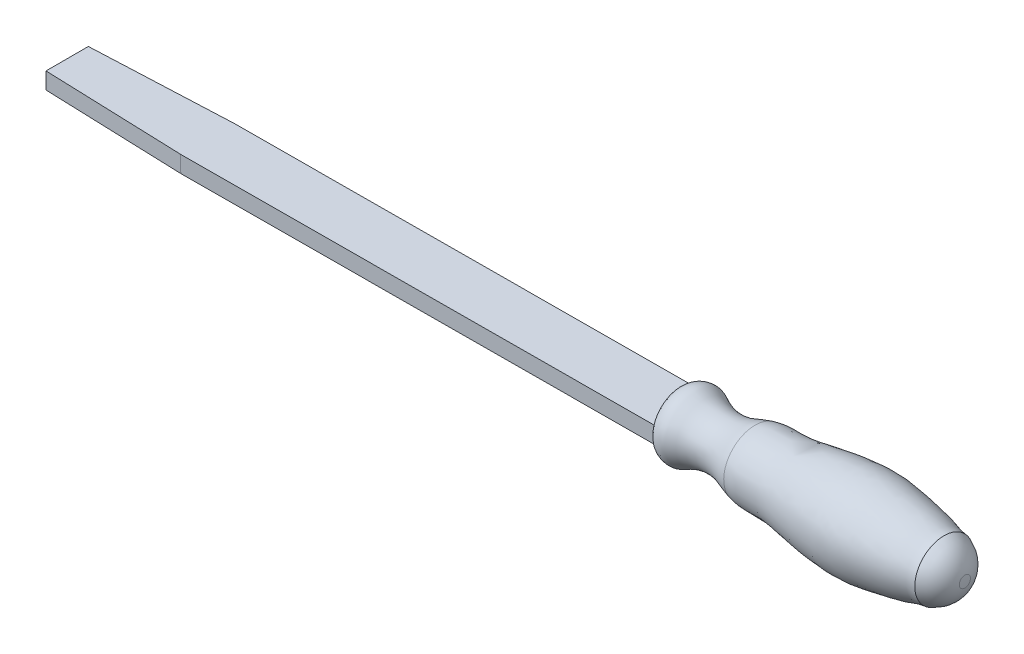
ISO-10303-21;
HEADER;
FILE_DESCRIPTION(('STEP AP214'),'2;1');
FILE_NAME('part.step','',(''),(''),'','','');
FILE_SCHEMA(('AUTOMOTIVE_DESIGN { 1 0 10303 214 1 1 1 1 }'));
ENDSEC;
DATA;
#1=APPLICATION_CONTEXT('core data for automotive mechanical design processes');
#2=APPLICATION_PROTOCOL_DEFINITION('international standard','automotive_design',2000,#1);
#3=PRODUCT_CONTEXT('',#1,'mechanical');
#4=PRODUCT('Part','Part','',(#3));
#5=PRODUCT_RELATED_PRODUCT_CATEGORY('part','',(#4));
#6=PRODUCT_DEFINITION_FORMATION('','',#4);
#7=PRODUCT_DEFINITION_CONTEXT('part definition',#1,'design');
#8=PRODUCT_DEFINITION('design','',#6,#7);
#9=PRODUCT_DEFINITION_SHAPE('','',#8);
#10=(LENGTH_UNIT() NAMED_UNIT(*) SI_UNIT(.MILLI.,.METRE.));
#11=(NAMED_UNIT(*) PLANE_ANGLE_UNIT() SI_UNIT($,.RADIAN.));
#12=(NAMED_UNIT(*) SI_UNIT($,.STERADIAN.) SOLID_ANGLE_UNIT());
#13=UNCERTAINTY_MEASURE_WITH_UNIT(LENGTH_MEASURE(1.E-05),#10,'distance_accuracy_value','');
#14=(GEOMETRIC_REPRESENTATION_CONTEXT(3) GLOBAL_UNCERTAINTY_ASSIGNED_CONTEXT((#13)) GLOBAL_UNIT_ASSIGNED_CONTEXT((#10,
#11,#12)) REPRESENTATION_CONTEXT('',''));
#15=CARTESIAN_POINT('',(0.,0.,0.));
#16=DIRECTION('',(0.,0.,1.));
#17=DIRECTION('',(1.,0.,0.));
#18=AXIS2_PLACEMENT_3D('',#15,#16,#17);
#19=CARTESIAN_POINT('',(-239.997930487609,-4.40953316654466,10.5));
#20=DIRECTION('',(0.00483121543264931,-0.999988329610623,0.));
#21=DIRECTION('',(0.999988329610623,0.00483121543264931,0.));
#22=AXIS2_PLACEMENT_3D('',#19,#20,#21);
#23=PLANE('',#22);
#24=DIRECTION('',(0.999988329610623,0.00483121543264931,0.));
#25=VECTOR('',#24,1.);
#26=CARTESIAN_POINT('',(-239.997930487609,-4.40953316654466,10.5));
#27=LINE('',#26,#25);
#28=CARTESIAN_POINT('',(-184.998572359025,-4.14381631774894,10.5));
#29=VERTEX_POINT('',#28);
#30=CARTESIAN_POINT('',(0.594520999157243,-3.24716563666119,10.5));
#31=VERTEX_POINT('',#30);
#32=EDGE_CURVE('E158',#29,#31,#27,.T.);
#33=ORIENTED_EDGE('',*,*,#32,.F.);
#34=DIRECTION('',(-0.999189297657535,-0.0048273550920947,-0.0399680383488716));
#35=VECTOR('',#34,1.);
#36=CARTESIAN_POINT('',(-239.910072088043,-4.40910869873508,8.30351437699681));
#37=LINE('',#36,#35);
#38=CARTESIAN_POINT('',(-239.997930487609,-4.40953316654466,8.3));
#39=VERTEX_POINT('',#38);
#40=EDGE_CURVE('E136',#29,#39,#37,.T.);
#41=ORIENTED_EDGE('',*,*,#40,.T.);
#42=DIRECTION('',(0.,0.,-1.));
#43=VECTOR('',#42,1.);
#44=CARTESIAN_POINT('',(-239.997930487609,-4.40953316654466,10.5));
#45=LINE('',#44,#43);
#46=CARTESIAN_POINT('',(-239.997930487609,-4.40953316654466,-8.3));
#47=VERTEX_POINT('',#46);
#48=EDGE_CURVE('E62',#39,#47,#45,.T.);
#49=ORIENTED_EDGE('',*,*,#48,.T.);
#50=DIRECTION('',(-0.999189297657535,-0.0048273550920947,0.0399680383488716));
#51=VECTOR('',#50,1.);
#52=CARTESIAN_POINT('',(-240.74872044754,-4.41316043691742,-8.26996805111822));
#53=LINE('',#52,#51);
#54=CARTESIAN_POINT('',(-184.998572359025,-4.14381631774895,-10.5));
#55=VERTEX_POINT('',#54);
#56=EDGE_CURVE('E244',#55,#47,#53,.T.);
#57=ORIENTED_EDGE('',*,*,#56,.F.);
#58=DIRECTION('',(0.999988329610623,0.00483121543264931,0.));
#59=VECTOR('',#58,1.);
#60=CARTESIAN_POINT('',(-239.997930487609,-4.40953316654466,-10.5));
#61=LINE('',#60,#59);
#62=CARTESIAN_POINT('',(0.594520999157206,-3.24716563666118,-10.5));
#63=VERTEX_POINT('',#62);
#64=EDGE_CURVE('E163',#55,#63,#61,.T.);
#65=ORIENTED_EDGE('',*,*,#64,.T.);
#66=CARTESIAN_POINT('',(0.594520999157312,-3.24716563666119,-10.5));
#67=CARTESIAN_POINT('',(0.579849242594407,-3.24723651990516,-10.4807894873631));
#68=CARTESIAN_POINT('',(0.56534511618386,-3.24730659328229,-10.4614554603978));
#69=CARTESIAN_POINT('',(0.536672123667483,-3.2474451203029,-10.4225403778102));
#70=CARTESIAN_POINT('',(0.522503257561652,-3.24751357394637,-10.402959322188));
#71=CARTESIAN_POINT('',(0.50850202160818,-3.24758121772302,-10.3832547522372));
#72=B_SPLINE_CURVE_WITH_KNOTS('',3,(#66,#67,#68,#69,#70,#71),.UNSPECIFIED.,.F.,.F.,(4,2,4),(0.,
0.0725093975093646,0.145018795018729),.UNSPECIFIED.);
#73=CARTESIAN_POINT('',(0.50850202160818,-3.24758121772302,-10.3832547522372));
#74=VERTEX_POINT('',#73);
#75=EDGE_CURVE('E277',#63,#74,#72,.T.);
#76=ORIENTED_EDGE('',*,*,#75,.T.);
#77=CARTESIAN_POINT('',(0.50850202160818,-3.24758121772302,-10.3832547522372));
#78=CARTESIAN_POINT('',(0.472133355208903,-3.24775692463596,-10.1759162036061));
#79=CARTESIAN_POINT('',(0.437648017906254,-3.24792353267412,-9.96824761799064));
#80=CARTESIAN_POINT('',(0.372440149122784,-3.24823856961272,-9.55232557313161));
#81=CARTESIAN_POINT('',(0.34171752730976,-3.24838699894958,-9.34407212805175));
#82=CARTESIAN_POINT('',(0.284029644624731,-3.24866570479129,-8.92704671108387));
#83=CARTESIAN_POINT('',(0.257064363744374,-3.2487959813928,-8.71827474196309));
#84=CARTESIAN_POINT('',(0.20690704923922,-3.24903830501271,-8.30061498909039));
#85=CARTESIAN_POINT('',(0.183709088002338,-3.24915038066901,-8.09172791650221));
#86=CARTESIAN_POINT('',(0.140994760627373,-3.24935674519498,-7.67357744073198));
#87=CARTESIAN_POINT('',(0.121478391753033,-3.24945103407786,-7.46431403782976));
#88=CARTESIAN_POINT('',(0.0860580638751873,-3.24962215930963,-7.04548902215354));
#89=CARTESIAN_POINT('',(0.0701540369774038,-3.24969899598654,-6.83592741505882));
#90=CARTESIAN_POINT('',(0.0245317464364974,-3.24991940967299,-6.15922763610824));
#91=CARTESIAN_POINT('',(0.00181261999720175,-3.25002917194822,-5.69159736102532));
#92=CARTESIAN_POINT('',(-0.0205015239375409,-3.2501369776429,-4.98972472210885));
#93=CARTESIAN_POINT('',(-0.0259787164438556,-3.25016343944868,-4.75564014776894));
#94=CARTESIAN_POINT('',(-0.0334182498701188,-3.25019938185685,-4.28741498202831));
#95=CARTESIAN_POINT('',(-0.0353806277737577,-3.2502088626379,-4.05327439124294));
#96=CARTESIAN_POINT('',(-0.036188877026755,-3.25021276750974,-3.66263496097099));
#97=CARTESIAN_POINT('',(-0.0358524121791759,-3.2502111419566,-3.50613632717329));
#98=CARTESIAN_POINT('',(-0.0340861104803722,-3.25020260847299,-3.19314452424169));
#99=CARTESIAN_POINT('',(-0.0326562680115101,-3.25019570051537,-3.03665135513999));
#100=CARTESIAN_POINT('',(-0.0289792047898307,-3.25017793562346,-2.72367168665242));
#101=CARTESIAN_POINT('',(-0.0267319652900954,-3.2501670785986,-2.56718518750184));
#102=CARTESIAN_POINT('',(-0.021757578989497,-3.25014304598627,-2.25433472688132));
#103=CARTESIAN_POINT('',(-0.0190307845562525,-3.25012987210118,-2.09797075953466));
#104=CARTESIAN_POINT('',(-0.0134857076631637,-3.25010308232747,-1.78524801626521));
#105=CARTESIAN_POINT('',(-0.0106674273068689,-3.25008946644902,-1.6288892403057));
#106=CARTESIAN_POINT('',(-0.00535375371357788,-3.25006379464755,-1.31617544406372));
#107=CARTESIAN_POINT('',(-0.00285834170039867,-3.25005173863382,-1.15982042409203));
#108=CARTESIAN_POINT('',(-0.000731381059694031,-3.25004146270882,-1.00345926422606));
#109=B_SPLINE_CURVE_WITH_KNOTS('',3,(#77,#78,#79,#80,#81,#82,#83,#84,#85,#86,#87,#88,#89,#90,
#91,#92,#93,#94,#95,#96,#97,#98,#99,#100,#101,#102,#103,#104,#105,#106,#107,#108),.UNSPECIFIED.,
.F.,.F.,(4,2,2,2,2,2,2,2,2,2,2,2,2,2,2,4),(0.,0.631503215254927,1.26299126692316,
1.89447595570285,2.52495721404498,3.15543800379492,3.78590694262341,5.19009207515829,
5.89251944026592,6.59493941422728,7.06443286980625,7.53392873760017,8.00343537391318,
8.47259845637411,8.94175075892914,9.41087576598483),.UNSPECIFIED.);
#110=CARTESIAN_POINT('',(-0.000731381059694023,-3.25004146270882,-1.00345926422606));
#111=VERTEX_POINT('',#110);
#112=EDGE_CURVE('E288',#74,#111,#109,.T.);
#113=ORIENTED_EDGE('',*,*,#112,.T.);
#114=DIRECTION('',(0.,0.,-1.));
#115=VECTOR('',#114,1.);
#116=CARTESIAN_POINT('',(-0.000731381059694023,-3.25004146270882,10.5));
#117=LINE('',#116,#115);
#118=CARTESIAN_POINT('',(-0.000731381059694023,-3.25004146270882,1.00345926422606));
#119=VERTEX_POINT('',#118);
#120=EDGE_CURVE('E252',#119,#111,#117,.T.);
#121=ORIENTED_EDGE('',*,*,#120,.F.);
#122=CARTESIAN_POINT('',(-0.000731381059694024,-3.25004146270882,1.00345926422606));
#123=CARTESIAN_POINT('',(-0.00358865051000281,-3.25005526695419,1.21325289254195));
#124=CARTESIAN_POINT('',(-0.00710341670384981,-3.25007224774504,1.42303512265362));
#125=CARTESIAN_POINT('',(-0.0144615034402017,-3.2501077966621,1.84263861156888));
#126=CARTESIAN_POINT('',(-0.0183048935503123,-3.25012636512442,2.05245986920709));
#127=CARTESIAN_POINT('',(-0.0253320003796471,-3.25016031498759,2.47212987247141));
#128=CARTESIAN_POINT('',(-0.0285156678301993,-3.25017569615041,2.68197861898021));
#129=CARTESIAN_POINT('',(-0.0333948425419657,-3.25019926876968,3.10188449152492));
#130=CARTESIAN_POINT('',(-0.0350890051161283,-3.25020745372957,3.31194163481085));
#131=CARTESIAN_POINT('',(-0.036341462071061,-3.25021350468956,3.73204760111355));
#132=CARTESIAN_POINT('',(-0.0358999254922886,-3.25021137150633,3.94209642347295));
#133=CARTESIAN_POINT('',(-0.0324052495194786,-3.2501944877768,4.36216591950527));
#134=CARTESIAN_POINT('',(-0.0293522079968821,-3.25017973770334,4.57218659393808));
#135=CARTESIAN_POINT('',(-0.019767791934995,-3.25013343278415,5.01616384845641));
#136=CARTESIAN_POINT('',(-0.012878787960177,-3.25010015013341,5.25011298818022));
#137=CARTESIAN_POINT('',(0.00491859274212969,-3.25001416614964,5.71786534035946));
#138=CARTESIAN_POINT('',(0.0158270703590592,-3.24996146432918,5.95166854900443));
#139=CARTESIAN_POINT('',(0.0418961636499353,-3.24983551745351,6.41893766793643));
#140=CARTESIAN_POINT('',(0.0570549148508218,-3.24976228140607,6.65240368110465));
#141=CARTESIAN_POINT('',(0.0917875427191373,-3.24959447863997,7.11900103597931));
#142=CARTESIAN_POINT('',(0.111361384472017,-3.24949991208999,7.35213238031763));
#143=CARTESIAN_POINT('',(0.177124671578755,-3.2491821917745,8.05346103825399));
#144=CARTESIAN_POINT('',(0.230216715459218,-3.24892568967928,8.52104089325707));
#145=CARTESIAN_POINT('',(0.323955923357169,-3.24847281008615,9.22068392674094));
#146=CARTESIAN_POINT('',(0.357570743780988,-3.24831040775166,9.45371451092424));
#147=CARTESIAN_POINT('',(0.429505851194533,-3.24796286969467,9.91904972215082));
#148=CARTESIAN_POINT('',(0.467826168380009,-3.24777773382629,10.1513543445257));
#149=CARTESIAN_POINT('',(0.50850202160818,-3.24758121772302,10.3832547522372));
#150=B_SPLINE_CURVE_WITH_KNOTS('',3,(#122,#123,#124,#125,#126,#127,#128,#129,#130,#131,#132,
#133,#134,#135,#136,#137,#138,#139,#140,#141,#142,#143,#144,#145,#146,#147,#148,#149),
.UNSPECIFIED.,.F.,.F.,(4,2,2,2,2,2,2,2,2,2,2,2,2,4),(0.,0.629435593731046,1.25900476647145,
1.88862093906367,2.51880493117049,3.14893904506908,3.77904954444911,4.48116862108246,
5.18330532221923,5.88513449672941,6.58695812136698,7.99826814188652,8.70455639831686,
9.41084918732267),.UNSPECIFIED.);
#151=CARTESIAN_POINT('',(0.50850202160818,-3.24758121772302,10.3832547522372));
#152=VERTEX_POINT('',#151);
#153=EDGE_CURVE('E176',#119,#152,#150,.T.);
#154=ORIENTED_EDGE('',*,*,#153,.T.);
#155=CARTESIAN_POINT('',(0.50850202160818,-3.24758121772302,10.3832547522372));
#156=CARTESIAN_POINT('',(0.522503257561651,-3.24751357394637,10.4029593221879));
#157=CARTESIAN_POINT('',(0.536672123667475,-3.2474451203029,10.4225403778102));
#158=CARTESIAN_POINT('',(0.56534511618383,-3.24730659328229,10.4614554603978));
#159=CARTESIAN_POINT('',(0.57984924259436,-3.24723651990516,10.4807894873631));
#160=CARTESIAN_POINT('',(0.594520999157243,-3.24716563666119,10.5));
#161=B_SPLINE_CURVE_WITH_KNOTS('',3,(#155,#156,#157,#158,#159,#160),.UNSPECIFIED.,.F.,.F.,(4,2,
4),(0.,0.0725093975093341,0.145018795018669),.UNSPECIFIED.);
#162=EDGE_CURVE('E383',#152,#31,#161,.T.);
#163=ORIENTED_EDGE('',*,*,#162,.T.);
#164=EDGE_LOOP('',(#33,#41,#49,#57,#65,#76,#113,#121,#154,#163));
#165=FACE_BOUND('',#164,.T.);
#166=ADVANCED_FACE('F39',(#165),#23,.T.);
#167=CARTESIAN_POINT('',(-239.997930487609,-4.40953316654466,10.5));
#168=DIRECTION('',(0.,0.,1.));
#169=DIRECTION('',(1.,0.,0.));
#170=AXIS2_PLACEMENT_3D('',#167,#168,#169);
#171=PLANE('',#170);
#172=DIRECTION('',(0.999988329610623,0.00483121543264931,0.));
#173=VECTOR('',#172,1.);
#174=CARTESIAN_POINT('',(-240.029333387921,2.09039097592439,10.5));
#175=LINE('',#174,#173);
#176=CARTESIAN_POINT('',(-185.029975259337,2.3561078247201,10.5));
#177=VERTEX_POINT('',#176);
#178=CARTESIAN_POINT('',(0.563118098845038,3.25275850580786,10.5));
#179=VERTEX_POINT('',#178);
#180=EDGE_CURVE('E146',#177,#179,#175,.T.);
#181=ORIENTED_EDGE('',*,*,#180,.F.);
#182=DIRECTION('',(-0.00483121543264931,0.999988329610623,0.));
#183=VECTOR('',#182,1.);
#184=CARTESIAN_POINT('',(-184.932325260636,-17.8559610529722,10.5));
#185=LINE('',#184,#183);
#186=EDGE_CURVE('E134',#29,#177,#185,.T.);
#187=ORIENTED_EDGE('',*,*,#186,.F.);
#188=ORIENTED_EDGE('',*,*,#32,.T.);
#189=CARTESIAN_POINT('',(0.605532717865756,-3.29228815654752,10.5000000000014));
#190=CARTESIAN_POINT('',(0.596448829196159,-3.2554492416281,10.5000000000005));
#191=CARTESIAN_POINT('',(0.587582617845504,-3.21855683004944,10.5000000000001));
#192=CARTESIAN_POINT('',(0.570273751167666,-3.14467751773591,10.4999999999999));
#193=CARTESIAN_POINT('',(0.561831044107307,-3.10769062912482,10.5));
#194=CARTESIAN_POINT('',(0.545355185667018,-3.03362591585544,10.5));
#195=CARTESIAN_POINT('',(0.537322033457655,-2.99654809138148,10.5));
#196=CARTESIAN_POINT('',(0.521652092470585,-2.92230401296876,10.5));
#197=CARTESIAN_POINT('',(0.51401535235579,-2.88513774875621,10.5));
#198=CARTESIAN_POINT('',(0.506571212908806,-2.84793309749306,10.5));
#199=B_SPLINE_CURVE_WITH_KNOTS('',3,(#189,#190,#191,#192,#193,#194,#195,#196,#197,#198),
.UNSPECIFIED.,.F.,.F.,(4,2,2,2,4),(0.,0.113826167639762,0.227638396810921,0.341450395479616,
0.455276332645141),.UNSPECIFIED.);
#200=CARTESIAN_POINT('',(0.506571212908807,-2.84793309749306,10.5));
#201=VERTEX_POINT('',#200);
#202=EDGE_CURVE('E387',#31,#201,#199,.T.);
#203=ORIENTED_EDGE('',*,*,#202,.T.);
#204=CARTESIAN_POINT('',(0.506571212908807,-2.84793309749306,10.5));
#205=CARTESIAN_POINT('',(0.493994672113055,-2.61052896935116,10.5));
#206=CARTESIAN_POINT('',(0.482918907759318,-2.37304650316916,10.5));
#207=CARTESIAN_POINT('',(0.463690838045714,-1.8980648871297,10.5));
#208=CARTESIAN_POINT('',(0.455537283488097,-1.66056578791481,10.5));
#209=CARTESIAN_POINT('',(0.442066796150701,-1.18555394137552,10.5));
#210=CARTESIAN_POINT('',(0.43674907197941,-0.948041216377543,10.5));
#211=CARTESIAN_POINT('',(0.42890007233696,-0.473003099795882,10.5));
#212=CARTESIAN_POINT('',(0.426368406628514,-0.235477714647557,10.5));
#213=CARTESIAN_POINT('',(0.424073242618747,0.239586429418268,10.5));
#214=CARTESIAN_POINT('',(0.424309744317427,0.477125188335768,10.5));
#215=CARTESIAN_POINT('',(0.42756840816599,0.952216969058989,10.5));
#216=CARTESIAN_POINT('',(0.430590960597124,1.18976998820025,10.5));
#217=CARTESIAN_POINT('',(0.439471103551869,1.66488981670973,10.5));
#218=CARTESIAN_POINT('',(0.445329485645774,1.90245661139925,10.5));
#219=CARTESIAN_POINT('',(0.459967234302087,2.3776018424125,10.5));
#220=CARTESIAN_POINT('',(0.468747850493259,2.61518024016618,10.5));
#221=CARTESIAN_POINT('',(0.479029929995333,2.85269480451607,10.5));
#222=B_SPLINE_CURVE_WITH_KNOTS('',3,(#204,#205,#206,#207,#208,#209,#210,#211,#212,#213,#214,
#215,#216,#217,#218,#219,#220,#221),.UNSPECIFIED.,.F.,.F.,(4,2,2,2,2,2,2,2,4),(0.,
0.713204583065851,1.4261039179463,2.13880420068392,2.85140464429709,3.56400508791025,
4.27670537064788,4.98960470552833,5.70280928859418),.UNSPECIFIED.);
#223=CARTESIAN_POINT('',(0.479029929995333,2.85269480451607,10.5));
#224=VERTEX_POINT('',#223);
#225=EDGE_CURVE('E392',#201,#224,#222,.T.);
#226=ORIENTED_EDGE('',*,*,#225,.T.);
#227=CARTESIAN_POINT('',(0.479029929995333,2.85269480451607,10.5));
#228=CARTESIAN_POINT('',(0.48950899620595,2.90782978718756,10.5));
#229=CARTESIAN_POINT('',(0.500409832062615,2.96288539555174,10.5));
#230=CARTESIAN_POINT('',(0.523088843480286,3.07278063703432,10.5));
#231=CARTESIAN_POINT('',(0.534866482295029,3.12762038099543,10.5));
#232=CARTESIAN_POINT('',(0.559341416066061,3.23707529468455,10.5));
#233=CARTESIAN_POINT('',(0.572038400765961,3.29169053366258,10.5));
#234=CARTESIAN_POINT('',(0.598399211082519,3.40068983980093,10.5));
#235=CARTESIAN_POINT('',(0.612063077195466,3.45507389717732,10.5));
#236=CARTESIAN_POINT('',(0.640406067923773,3.56359438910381,10.5));
#237=CARTESIAN_POINT('',(0.655085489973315,3.61773074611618,10.5));
#238=CARTESIAN_POINT('',(0.685512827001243,3.72574073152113,10.5));
#239=CARTESIAN_POINT('',(0.70126144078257,3.77961416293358,10.5));
#240=CARTESIAN_POINT('',(0.717563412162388,3.83332087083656,10.5));
#241=B_SPLINE_CURVE_WITH_KNOTS('',3,(#227,#228,#229,#230,#231,#232,#233,#234,#235,#236,#237,
#238,#239,#240),.UNSPECIFIED.,.F.,.F.,(4,2,2,2,2,2,4),(0.,0.1683654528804,0.336628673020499,
0.504835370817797,0.673049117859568,0.841312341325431,1.00968661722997),.UNSPECIFIED.);
#242=EDGE_CURVE('E156',#224,#179,#241,.T.);
#243=ORIENTED_EDGE('',*,*,#242,.T.);
#244=EDGE_LOOP('',(#181,#187,#188,#203,#226,#243));
#245=FACE_BOUND('',#244,.T.);
#246=ADVANCED_FACE('F154',(#245),#171,.T.);
#247=CARTESIAN_POINT('',(-240.029333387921,2.09039097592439,10.5));
#248=DIRECTION('',(-0.00483121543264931,0.999988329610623,0.));
#249=DIRECTION('',(-0.999988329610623,-0.00483121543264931,0.));
#250=AXIS2_PLACEMENT_3D('',#247,#248,#249);
#251=PLANE('',#250);
#252=DIRECTION('',(0.,0.,1.));
#253=VECTOR('',#252,1.);
#254=CARTESIAN_POINT('',(-240.029333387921,2.09039097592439,10.5));
#255=LINE('',#254,#253);
#256=CARTESIAN_POINT('',(-240.029333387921,2.09039097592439,-8.3));
#257=VERTEX_POINT('',#256);
#258=CARTESIAN_POINT('',(-240.029333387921,2.09039097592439,8.3));
#259=VERTEX_POINT('',#258);
#260=EDGE_CURVE('E150',#257,#259,#255,.T.);
#261=ORIENTED_EDGE('',*,*,#260,.T.);
#262=DIRECTION('',(0.999189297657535,0.0048273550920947,0.0399680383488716));
#263=VECTOR('',#262,1.);
#264=CARTESIAN_POINT('',(-240.029333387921,2.09039097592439,8.3));
#265=LINE('',#264,#263);
#266=EDGE_CURVE('E55',#259,#177,#265,.T.);
#267=ORIENTED_EDGE('',*,*,#266,.T.);
#268=ORIENTED_EDGE('',*,*,#180,.T.);
#269=CARTESIAN_POINT('',(0.563118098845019,3.25275850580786,10.5));
#270=CARTESIAN_POINT('',(0.548446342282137,3.25268762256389,10.4807894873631));
#271=CARTESIAN_POINT('',(0.533942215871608,3.25261754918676,10.4614554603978));
#272=CARTESIAN_POINT('',(0.505269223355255,3.25247902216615,10.4225403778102));
#273=CARTESIAN_POINT('',(0.491100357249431,3.25241056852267,10.4029593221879));
#274=CARTESIAN_POINT('',(0.47709912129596,3.25234292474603,10.3832547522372));
#275=B_SPLINE_CURVE_WITH_KNOTS('',3,(#269,#270,#271,#272,#273,#274),.UNSPECIFIED.,.F.,.F.,(4,2,
4),(0.,0.0725093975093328,0.145018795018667),.UNSPECIFIED.);
#276=CARTESIAN_POINT('',(0.47709912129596,3.25234292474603,10.3832547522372));
#277=VERTEX_POINT('',#276);
#278=EDGE_CURVE('E261',#179,#277,#275,.T.);
#279=ORIENTED_EDGE('',*,*,#278,.T.);
#280=CARTESIAN_POINT('',(0.47709912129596,3.25234292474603,10.3832547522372));
#281=CARTESIAN_POINT('',(0.440730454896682,3.25216721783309,10.1759162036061));
#282=CARTESIAN_POINT('',(0.406245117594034,3.25200060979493,9.96824761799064));
#283=CARTESIAN_POINT('',(0.341037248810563,3.25168557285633,9.55232557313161));
#284=CARTESIAN_POINT('',(0.310314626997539,3.25153714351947,9.34407212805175));
#285=CARTESIAN_POINT('',(0.252626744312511,3.25125843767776,8.92704671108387));
#286=CARTESIAN_POINT('',(0.225661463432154,3.25112816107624,8.71827474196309));
#287=CARTESIAN_POINT('',(0.175504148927,3.25088583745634,8.30061498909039));
#288=CARTESIAN_POINT('',(0.152306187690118,3.25077376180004,8.09172791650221));
#289=CARTESIAN_POINT('',(0.109591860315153,3.25056739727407,7.67357744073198));
#290=CARTESIAN_POINT('',(0.0900754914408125,3.25047310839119,7.46431403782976));
#291=CARTESIAN_POINT('',(0.0546551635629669,3.25030198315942,7.04548902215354));
#292=CARTESIAN_POINT('',(0.0387511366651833,3.25022514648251,6.83592741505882));
#293=CARTESIAN_POINT('',(-0.00687115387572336,3.25000473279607,6.15922763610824));
#294=CARTESIAN_POINT('',(-0.0295902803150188,3.24989497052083,5.69159736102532));
#295=CARTESIAN_POINT('',(-0.0519044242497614,3.24978716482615,4.98972472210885));
#296=CARTESIAN_POINT('',(-0.0573816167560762,3.24976070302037,4.75564014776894));
#297=CARTESIAN_POINT('',(-0.0648211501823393,3.2497247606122,4.28741498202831));
#298=CARTESIAN_POINT('',(-0.0667835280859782,3.24971527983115,4.05327439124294));
#299=CARTESIAN_POINT('',(-0.0675917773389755,3.24971137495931,3.66263496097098));
#300=CARTESIAN_POINT('',(-0.0672553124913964,3.24971300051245,3.50613632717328));
#301=CARTESIAN_POINT('',(-0.0654890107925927,3.24972153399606,3.19314452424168));
#302=CARTESIAN_POINT('',(-0.0640591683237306,3.24972844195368,3.03665135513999));
#303=CARTESIAN_POINT('',(-0.0603821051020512,3.24974620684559,2.72367168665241));
#304=CARTESIAN_POINT('',(-0.0581348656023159,3.24975706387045,2.56718518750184));
#305=CARTESIAN_POINT('',(-0.0531604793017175,3.24978109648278,2.25433472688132));
#306=CARTESIAN_POINT('',(-0.050433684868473,3.24979427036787,2.09797075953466));
#307=CARTESIAN_POINT('',(-0.0448886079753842,3.24982106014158,1.78524801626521));
#308=CARTESIAN_POINT('',(-0.0420703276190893,3.24983467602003,1.62888924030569));
#309=CARTESIAN_POINT('',(-0.0367566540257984,3.2498603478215,1.31617544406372));
#310=CARTESIAN_POINT('',(-0.0342612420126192,3.24987240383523,1.15982042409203));
#311=CARTESIAN_POINT('',(-0.0321342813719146,3.24988267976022,1.00345926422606));
#312=B_SPLINE_CURVE_WITH_KNOTS('',3,(#280,#281,#282,#283,#284,#285,#286,#287,#288,#289,#290,
#291,#292,#293,#294,#295,#296,#297,#298,#299,#300,#301,#302,#303,#304,#305,#306,#307,#308,#309,
#310,#311),.UNSPECIFIED.,.F.,.F.,(4,2,2,2,2,2,2,2,2,2,2,2,2,2,2,4),(0.,0.631503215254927,
1.26299126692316,1.89447595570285,2.52495721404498,3.15543800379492,3.78590694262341,
5.19009207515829,5.89251944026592,6.59493941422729,7.06443286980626,7.53392873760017,
8.00343537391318,8.47259845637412,8.94175075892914,9.41087576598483),.UNSPECIFIED.);
#313=CARTESIAN_POINT('',(-0.0321342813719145,3.24988267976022,1.00345926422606));
#314=VERTEX_POINT('',#313);
#315=EDGE_CURVE('E272',#277,#314,#312,.T.);
#316=ORIENTED_EDGE('',*,*,#315,.T.);
#317=DIRECTION('',(0.,0.,1.));
#318=VECTOR('',#317,1.);
#319=CARTESIAN_POINT('',(-0.0321342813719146,3.24988267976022,10.5));
#320=LINE('',#319,#318);
#321=CARTESIAN_POINT('',(-0.0321342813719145,3.24988267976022,-1.00345926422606));
#322=VERTEX_POINT('',#321);
#323=EDGE_CURVE('E258',#322,#314,#320,.T.);
#324=ORIENTED_EDGE('',*,*,#323,.F.);
#325=CARTESIAN_POINT('',(-0.0321342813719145,3.24988267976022,-1.00345926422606));
#326=CARTESIAN_POINT('',(-0.0349915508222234,3.24986887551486,-1.21325289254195));
#327=CARTESIAN_POINT('',(-0.0385063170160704,3.24985189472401,-1.42303512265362));
#328=CARTESIAN_POINT('',(-0.0458644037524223,3.24981634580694,-1.84263861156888));
#329=CARTESIAN_POINT('',(-0.0497077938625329,3.24979777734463,-2.0524598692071));
#330=CARTESIAN_POINT('',(-0.0567349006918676,3.24976382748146,-2.47212987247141));
#331=CARTESIAN_POINT('',(-0.0599185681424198,3.24974844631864,-2.68197861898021));
#332=CARTESIAN_POINT('',(-0.0647977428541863,3.24972487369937,-3.10188449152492));
#333=CARTESIAN_POINT('',(-0.0664919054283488,3.24971668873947,-3.31194163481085));
#334=CARTESIAN_POINT('',(-0.0677443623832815,3.24971063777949,-3.73204760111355));
#335=CARTESIAN_POINT('',(-0.0673028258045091,3.24971277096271,-3.94209642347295));
#336=CARTESIAN_POINT('',(-0.0638081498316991,3.24972965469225,-4.36216591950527));
#337=CARTESIAN_POINT('',(-0.0607551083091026,3.24974440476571,-4.57218659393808));
#338=CARTESIAN_POINT('',(-0.0511706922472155,3.2497907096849,-5.01616384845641));
#339=CARTESIAN_POINT('',(-0.0442816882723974,3.24982399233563,-5.25011298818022));
#340=CARTESIAN_POINT('',(-0.0264843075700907,3.24990997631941,-5.71786534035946));
#341=CARTESIAN_POINT('',(-0.0155758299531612,3.24996267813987,-5.95166854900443));
#342=CARTESIAN_POINT('',(0.0104932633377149,3.25008862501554,-6.41893766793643));
#343=CARTESIAN_POINT('',(0.0256520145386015,3.25016186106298,-6.65240368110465));
#344=CARTESIAN_POINT('',(0.060384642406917,3.25032966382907,-7.11900103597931));
#345=CARTESIAN_POINT('',(0.0799584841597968,3.25042423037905,-7.35213238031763));
#346=CARTESIAN_POINT('',(0.145721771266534,3.25074195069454,-8.05346103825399));
#347=CARTESIAN_POINT('',(0.198813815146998,3.25099845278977,-8.52104089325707));
#348=CARTESIAN_POINT('',(0.292553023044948,3.25145133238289,-9.22068392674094));
#349=CARTESIAN_POINT('',(0.326167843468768,3.25161373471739,-9.45371451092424));
#350=CARTESIAN_POINT('',(0.398102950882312,3.25196127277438,-9.91904972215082));
#351=CARTESIAN_POINT('',(0.436423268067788,3.25214640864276,-10.1513543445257));
#352=CARTESIAN_POINT('',(0.47709912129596,3.25234292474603,-10.3832547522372));
#353=B_SPLINE_CURVE_WITH_KNOTS('',3,(#325,#326,#327,#328,#329,#330,#331,#332,#333,#334,#335,
#336,#337,#338,#339,#340,#341,#342,#343,#344,#345,#346,#347,#348,#349,#350,#351,#352),
.UNSPECIFIED.,.F.,.F.,(4,2,2,2,2,2,2,2,2,2,2,2,2,4),(0.,0.629435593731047,1.25900476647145,
1.88862093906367,2.5188049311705,3.14893904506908,3.77904954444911,4.48116862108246,
5.18330532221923,5.88513449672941,6.58695812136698,7.99826814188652,8.70455639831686,
9.41084918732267),.UNSPECIFIED.);
#354=CARTESIAN_POINT('',(0.47709912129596,3.25234292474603,-10.3832547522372));
#355=VERTEX_POINT('',#354);
#356=EDGE_CURVE('E168',#322,#355,#353,.T.);
#357=ORIENTED_EDGE('',*,*,#356,.T.);
#358=CARTESIAN_POINT('',(0.47709912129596,3.25234292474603,-10.3832547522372));
#359=CARTESIAN_POINT('',(0.491100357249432,3.25241056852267,-10.4029593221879));
#360=CARTESIAN_POINT('',(0.505269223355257,3.25247902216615,-10.4225403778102));
#361=CARTESIAN_POINT('',(0.533942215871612,3.25261754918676,-10.4614554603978));
#362=CARTESIAN_POINT('',(0.548446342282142,3.25268762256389,-10.4807894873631));
#363=CARTESIAN_POINT('',(0.563118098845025,3.25275850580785,-10.5));
#364=B_SPLINE_CURVE_WITH_KNOTS('',3,(#358,#359,#360,#361,#362,#363),.UNSPECIFIED.,.F.,.F.,(4,2,
4),(0.,0.0725093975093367,0.145018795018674),.UNSPECIFIED.);
#365=CARTESIAN_POINT('',(0.563118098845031,3.25275850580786,-10.5));
#366=VERTEX_POINT('',#365);
#367=EDGE_CURVE('E294',#355,#366,#364,.T.);
#368=ORIENTED_EDGE('',*,*,#367,.T.);
#369=DIRECTION('',(0.999988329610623,0.00483121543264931,0.));
#370=VECTOR('',#369,1.);
#371=CARTESIAN_POINT('',(-240.029333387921,2.09039097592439,-10.5));
#372=LINE('',#371,#370);
#373=CARTESIAN_POINT('',(-185.029975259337,2.3561078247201,-10.5));
#374=VERTEX_POINT('',#373);
#375=EDGE_CURVE('E159',#374,#366,#372,.T.);
#376=ORIENTED_EDGE('',*,*,#375,.F.);
#377=DIRECTION('',(0.999189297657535,0.0048273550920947,-0.0399680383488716));
#378=VECTOR('',#377,1.);
#379=CARTESIAN_POINT('',(-240.029333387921,2.09039097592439,-8.3));
#380=LINE('',#379,#378);
#381=EDGE_CURVE('E242',#257,#374,#380,.T.);
#382=ORIENTED_EDGE('',*,*,#381,.F.);
#383=EDGE_LOOP('',(#261,#267,#268,#279,#316,#324,#357,#368,#376,#382));
#384=FACE_BOUND('',#383,.T.);
#385=ADVANCED_FACE('F144',(#384),#251,.T.);
#386=CARTESIAN_POINT('',(-240.013631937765,-1.15957109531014,0.));
#387=DIRECTION('',(-0.999988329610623,-0.00483121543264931,0.));
#388=DIRECTION('',(0.00483121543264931,-0.999988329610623,0.));
#389=AXIS2_PLACEMENT_3D('',#386,#387,#388);
#390=PLANE('',#389);
#391=ORIENTED_EDGE('',*,*,#48,.F.);
#392=DIRECTION('',(-0.00483121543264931,0.999988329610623,0.));
#393=VECTOR('',#392,1.);
#394=CARTESIAN_POINT('',(-240.013631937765,-1.15957109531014,8.3));
#395=LINE('',#394,#393);
#396=EDGE_CURVE('E11',#39,#259,#395,.T.);
#397=ORIENTED_EDGE('',*,*,#396,.T.);
#398=ORIENTED_EDGE('',*,*,#260,.F.);
#399=DIRECTION('',(-0.00483121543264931,0.999988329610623,0.));
#400=VECTOR('',#399,1.);
#401=CARTESIAN_POINT('',(-240.013631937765,-1.15957109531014,-8.3));
#402=LINE('',#401,#400);
#403=EDGE_CURVE('E48',#47,#257,#402,.T.);
#404=ORIENTED_EDGE('',*,*,#403,.F.);
#405=EDGE_LOOP('',(#391,#397,#398,#404));
#406=FACE_BOUND('',#405,.T.);
#407=ADVANCED_FACE('F190',(#406),#390,.T.);
#408=CARTESIAN_POINT('',(0.,-3.40142625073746,0.));
#409=CARTESIAN_POINT('',(-0.15562647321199,-7.16439135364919,0.));
#410=CARTESIAN_POINT('',(0.545364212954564,-10.8774958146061,0.));
#411=B_SPLINE_CURVE_WITH_KNOTS('',2,(#408,#409,#410),.UNSPECIFIED.,.F.,.F.,(3,3),(0.,1.),.UNSPECIFIED.);
#412=CARTESIAN_POINT('',(0.,0.,0.));
#413=DIRECTION('',(-0.999988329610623,-0.00483121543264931,0.));
#414=AXIS1_PLACEMENT('',#412,#413);
#415=SURFACE_OF_REVOLUTION('',#411,#414);
#416=CARTESIAN_POINT('',(0.479029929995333,2.85269480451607,-10.5));
#417=CARTESIAN_POINT('',(0.468747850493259,2.61518024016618,-10.5));
#418=CARTESIAN_POINT('',(0.459967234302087,2.3776018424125,-10.5));
#419=CARTESIAN_POINT('',(0.445329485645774,1.90245661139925,-10.5));
#420=CARTESIAN_POINT('',(0.439471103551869,1.66488981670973,-10.5));
#421=CARTESIAN_POINT('',(0.430590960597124,1.18976998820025,-10.5));
#422=CARTESIAN_POINT('',(0.42756840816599,0.95221696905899,-10.5));
#423=CARTESIAN_POINT('',(0.424309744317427,0.477125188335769,-10.5));
#424=CARTESIAN_POINT('',(0.424073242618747,0.23958642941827,-10.5));
#425=CARTESIAN_POINT('',(0.426368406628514,-0.235477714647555,-10.5));
#426=CARTESIAN_POINT('',(0.42890007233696,-0.47300309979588,-10.5));
#427=CARTESIAN_POINT('',(0.43674907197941,-0.948041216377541,-10.5));
#428=CARTESIAN_POINT('',(0.442066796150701,-1.18555394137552,-10.5));
#429=CARTESIAN_POINT('',(0.455537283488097,-1.66056578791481,-10.5));
#430=CARTESIAN_POINT('',(0.463690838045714,-1.8980648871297,-10.5));
#431=CARTESIAN_POINT('',(0.482918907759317,-2.37304650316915,-10.5));
#432=CARTESIAN_POINT('',(0.493994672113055,-2.61052896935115,-10.5));
#433=CARTESIAN_POINT('',(0.506571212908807,-2.84793309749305,-10.5));
#434=B_SPLINE_CURVE_WITH_KNOTS('',3,(#416,#417,#418,#419,#420,#421,#422,#423,#424,#425,#426,
#427,#428,#429,#430,#431,#432,#433),.UNSPECIFIED.,.F.,.F.,(4,2,2,2,2,2,2,2,4),(0.,
0.71320458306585,1.4261039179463,2.13880420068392,2.85140464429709,3.56400508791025,
4.27670537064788,4.98960470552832,5.70280928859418),.UNSPECIFIED.);
#435=CARTESIAN_POINT('',(0.479029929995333,2.85269480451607,-10.5));
#436=VERTEX_POINT('',#435);
#437=CARTESIAN_POINT('',(0.506571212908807,-2.84793309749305,-10.5));
#438=VERTEX_POINT('',#437);
#439=EDGE_CURVE('E292',#436,#438,#434,.T.);
#440=ORIENTED_EDGE('',*,*,#439,.F.);
#441=CARTESIAN_POINT('',(0.49280057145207,0.00238085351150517,0.));
#442=DIRECTION('',(-0.999988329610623,-0.00483121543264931,0.));
#443=DIRECTION('',(0.00483121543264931,-0.999988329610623,0.));
#444=AXIS2_PLACEMENT_3D('',#441,#442,#443);
#445=CIRCLE('',#444,10.8800036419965);
#446=EDGE_CURVE('E232',#436,#438,#445,.T.);
#447=ORIENTED_EDGE('',*,*,#446,.T.);
#448=EDGE_LOOP('',(#440,#447));
#449=FACE_BOUND('',#448,.T.);
#450=ADVANCED_FACE('F455',(#449),#415,.F.);
#451=ORIENTED_EDGE('',*,*,#112,.F.);
#452=EDGE_CURVE('E228',#74,#152,#445,.T.);
#453=ORIENTED_EDGE('',*,*,#452,.T.);
#454=ORIENTED_EDGE('',*,*,#153,.F.);
#455=CARTESIAN_POINT('',(-0.0164328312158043,-7.93914743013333E-05,0.));
#456=DIRECTION('',(-0.999988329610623,-0.00483121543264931,0.));
#457=DIRECTION('',(0.00483121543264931,-0.999988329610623,0.));
#458=AXIS2_PLACEMENT_3D('',#455,#456,#457);
#459=CIRCLE('',#458,3.40138655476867);
#460=EDGE_CURVE('E238',#111,#119,#459,.T.);
#461=ORIENTED_EDGE('',*,*,#460,.F.);
#462=EDGE_LOOP('',(#451,#453,#454,#461));
#463=FACE_BOUND('',#462,.T.);
#464=ADVANCED_FACE('F357',(#463),#415,.F.);
#465=ORIENTED_EDGE('',*,*,#225,.F.);
#466=EDGE_CURVE('E233',#201,#224,#445,.T.);
#467=ORIENTED_EDGE('',*,*,#466,.T.);
#468=EDGE_LOOP('',(#465,#467));
#469=FACE_BOUND('',#468,.T.);
#470=ADVANCED_FACE('F448',(#469),#415,.F.);
#471=CARTESIAN_POINT('',(0.,0.,0.));
#472=DIRECTION('',(-0.999988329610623,-0.00483121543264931,0.));
#473=DIRECTION('',(0.00483121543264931,-0.999988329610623,0.));
#474=AXIS2_PLACEMENT_3D('',#471,#472,#473);
#475=CONICAL_SURFACE('',#474,0.,1.5659650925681);
#476=EDGE_CURVE('E234',#119,#314,#459,.T.);
#477=ORIENTED_EDGE('',*,*,#476,.T.);
#478=EDGE_CURVE('E237',#314,#322,#459,.T.);
#479=ORIENTED_EDGE('',*,*,#478,.T.);
#480=EDGE_CURVE('E361',#322,#111,#459,.T.);
#481=ORIENTED_EDGE('',*,*,#480,.T.);
#482=ORIENTED_EDGE('',*,*,#460,.T.);
#483=EDGE_LOOP('',(#477,#479,#481,#482));
#484=FACE_BOUND('',#483,.T.);
#485=CARTESIAN_POINT('',(0.,0.,0.));
#486=VERTEX_POINT('',#485);
#487=VERTEX_LOOP('',#486);
#488=FACE_BOUND('',#487,.T.);
#489=ADVANCED_FACE('F41',(#484,#488),#475,.F.);
#490=ORIENTED_EDGE('',*,*,#315,.F.);
#491=EDGE_CURVE('E379',#277,#355,#445,.T.);
#492=ORIENTED_EDGE('',*,*,#491,.T.);
#493=ORIENTED_EDGE('',*,*,#356,.F.);
#494=ORIENTED_EDGE('',*,*,#478,.F.);
#495=EDGE_LOOP('',(#490,#492,#493,#494));
#496=FACE_BOUND('',#495,.T.);
#497=ADVANCED_FACE('F183',(#496),#415,.F.);
#498=CARTESIAN_POINT('',(0.545364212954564,-10.8774958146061,0.));
#499=CARTESIAN_POINT('',(1.37034871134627,-11.9743869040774,0.));
#500=CARTESIAN_POINT('',(3.32259956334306,-12.8302408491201,0.));
#501=CARTESIAN_POINT('',(6.19462989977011,-12.9244191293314,0.));
#502=CARTESIAN_POINT('',(8.21729207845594,-11.8858709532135,0.));
#503=CARTESIAN_POINT('',(10.5136735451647,-10.6744661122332,0.));
#504=CARTESIAN_POINT('',(13.281514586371,-9.80869703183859,0.));
#505=CARTESIAN_POINT('',(16.6319516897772,-9.22347666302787,0.));
#506=CARTESIAN_POINT('',(20.2629187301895,-9.32596056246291,0.));
#507=CARTESIAN_POINT('',(24.1568373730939,-10.1633752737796,0.));
#508=CARTESIAN_POINT('',(27.1905964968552,-11.558728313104,0.));
#509=CARTESIAN_POINT('',(29.1632772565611,-12.0599366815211,0.));
#510=CARTESIAN_POINT('',(29.7779090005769,-12.2061348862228,0.));
#511=B_SPLINE_CURVE_WITH_KNOTS('',3,(#498,#499,#500,#501,#502,#503,#504,#505,#506,#507,#508,
#509,#510),.UNSPECIFIED.,.F.,.F.,(4,1,1,1,1,1,1,1,1,1,4),(0.,0.120356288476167,
0.182103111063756,0.252493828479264,0.320379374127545,0.416926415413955,0.511670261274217,
0.625759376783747,0.741661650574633,0.867963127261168,0.924773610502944),.UNSPECIFIED.);
#512=CARTESIAN_POINT('',(0.,0.,0.));
#513=DIRECTION('',(-0.999988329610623,-0.00483121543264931,0.));
#514=AXIS1_PLACEMENT('',#512,#513);
#515=SURFACE_OF_REVOLUTION('',#511,#514);
#516=CARTESIAN_POINT('',(0.506571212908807,-2.84793309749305,-10.5));
#517=CARTESIAN_POINT('',(0.51401535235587,-2.88513774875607,-10.5));
#518=CARTESIAN_POINT('',(0.521652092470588,-2.92230401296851,-10.5));
#519=CARTESIAN_POINT('',(0.537322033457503,-2.99654809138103,-10.5));
#520=CARTESIAN_POINT('',(0.545355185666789,-3.03362591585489,-10.5));
#521=CARTESIAN_POINT('',(0.561831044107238,-3.10769062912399,-10.5));
#522=CARTESIAN_POINT('',(0.570273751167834,-3.1446775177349,-10.5));
#523=CARTESIAN_POINT('',(0.587582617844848,-3.21855683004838,-10.5));
#524=CARTESIAN_POINT('',(0.596448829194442,-3.25544924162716,-10.5));
#525=CARTESIAN_POINT('',(0.605532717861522,-3.29228815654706,-10.5));
#526=B_SPLINE_CURVE_WITH_KNOTS('',3,(#516,#517,#518,#519,#520,#521,#522,#523,#524,#525),
.UNSPECIFIED.,.F.,.F.,(4,2,2,2,4),(0.,0.113825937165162,0.227637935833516,0.341450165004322,
0.45527633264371),.UNSPECIFIED.);
#527=EDGE_CURVE('E284',#438,#63,#526,.T.);
#528=ORIENTED_EDGE('',*,*,#527,.F.);
#529=ORIENTED_EDGE('',*,*,#446,.F.);
#530=CARTESIAN_POINT('',(0.71756341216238,3.83332087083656,-10.5));
#531=CARTESIAN_POINT('',(0.701261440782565,3.77961416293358,-10.5));
#532=CARTESIAN_POINT('',(0.685512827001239,3.72574073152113,-10.5));
#533=CARTESIAN_POINT('',(0.655085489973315,3.61773074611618,-10.5));
#534=CARTESIAN_POINT('',(0.640406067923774,3.56359438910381,-10.5));
#535=CARTESIAN_POINT('',(0.612063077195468,3.45507389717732,-10.5));
#536=CARTESIAN_POINT('',(0.598399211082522,3.40068983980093,-10.5));
#537=CARTESIAN_POINT('',(0.572038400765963,3.29169053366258,-10.5));
#538=CARTESIAN_POINT('',(0.559341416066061,3.23707529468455,-10.5));
#539=CARTESIAN_POINT('',(0.534866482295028,3.12762038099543,-10.5));
#540=CARTESIAN_POINT('',(0.523088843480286,3.07278063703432,-10.5));
#541=CARTESIAN_POINT('',(0.500409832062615,2.96288539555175,-10.5));
#542=CARTESIAN_POINT('',(0.48950899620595,2.90782978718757,-10.5));
#543=CARTESIAN_POINT('',(0.479029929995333,2.85269480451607,-10.5));
#544=B_SPLINE_CURVE_WITH_KNOTS('',3,(#530,#531,#532,#533,#534,#535,#536,#537,#538,#539,#540,
#541,#542,#543),.UNSPECIFIED.,.F.,.F.,(4,2,2,2,2,2,4),(0.,0.16837427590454,0.336637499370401,
0.504851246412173,0.673057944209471,0.841321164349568,1.00968661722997),.UNSPECIFIED.);
#545=EDGE_CURVE('E298',#366,#436,#544,.T.);
#546=ORIENTED_EDGE('',*,*,#545,.F.);
#547=ORIENTED_EDGE('',*,*,#367,.F.);
#548=ORIENTED_EDGE('',*,*,#491,.F.);
#549=ORIENTED_EDGE('',*,*,#278,.F.);
#550=ORIENTED_EDGE('',*,*,#242,.F.);
#551=ORIENTED_EDGE('',*,*,#466,.F.);
#552=ORIENTED_EDGE('',*,*,#202,.F.);
#553=ORIENTED_EDGE('',*,*,#162,.F.);
#554=ORIENTED_EDGE('',*,*,#452,.F.);
#555=ORIENTED_EDGE('',*,*,#75,.F.);
#556=EDGE_LOOP('',(#528,#529,#546,#547,#548,#549,#550,#551,#552,#553,#554,#555));
#557=FACE_BOUND('',#556,.T.);
#558=CARTESIAN_POINT('',(29.7182441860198,0.143576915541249,0.));
#559=DIRECTION('',(-0.999988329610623,-0.00483121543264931,0.));
#560=DIRECTION('',(0.00483121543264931,-0.999988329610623,0.));
#561=AXIS2_PLACEMENT_3D('',#558,#559,#560);
#562=CIRCLE('',#561,12.3498559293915);
#563=CARTESIAN_POINT('',(29.7779090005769,-12.2061348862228,0.));
#564=VERTEX_POINT('',#563);
#565=EDGE_CURVE('E224',#564,#564,#562,.T.);
#566=ORIENTED_EDGE('',*,*,#565,.T.);
#567=EDGE_LOOP('',(#566));
#568=FACE_BOUND('',#567,.T.);
#569=ADVANCED_FACE('F281',(#557,#568),#515,.F.);
#570=CARTESIAN_POINT('',(29.7779090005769,-12.2061348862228,0.));
#571=CARTESIAN_POINT('',(31.1346179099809,-12.4503532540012,0.));
#572=CARTESIAN_POINT('',(33.1675652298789,-12.8911490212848,0.));
#573=CARTESIAN_POINT('',(36.3876480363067,-12.9050924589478,0.));
#574=CARTESIAN_POINT('',(39.1715363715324,-12.8798778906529,0.));
#575=CARTESIAN_POINT('',(42.6259033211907,-12.9791040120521,0.));
#576=CARTESIAN_POINT('',(46.2180468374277,-13.3469629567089,0.));
#577=CARTESIAN_POINT('',(49.9167304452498,-14.0067787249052,0.));
#578=CARTESIAN_POINT('',(53.6218083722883,-14.6404916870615,0.));
#579=CARTESIAN_POINT('',(57.2661896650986,-15.1744291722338,0.));
#580=CARTESIAN_POINT('',(61.1201600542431,-15.6812353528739,0.));
#581=CARTESIAN_POINT('',(65.1405088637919,-15.9976015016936,0.));
#582=CARTESIAN_POINT('',(69.2720383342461,-16.4213874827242,0.));
#583=CARTESIAN_POINT('',(73.6065603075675,-16.3521229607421,0.));
#584=CARTESIAN_POINT('',(77.7838995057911,-16.2161925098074,0.));
#585=CARTESIAN_POINT('',(81.9902090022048,-15.5315842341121,0.));
#586=CARTESIAN_POINT('',(86.3140591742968,-14.8039570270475,0.));
#587=CARTESIAN_POINT('',(91.8474270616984,-13.8515046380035,0.));
#588=CARTESIAN_POINT('',(97.7508899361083,-12.5390196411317,0.));
#589=CARTESIAN_POINT('',(101.929439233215,-10.9603572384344,0.));
#590=CARTESIAN_POINT('',(103.818425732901,-10.9881922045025,0.));
#591=B_SPLINE_CURVE_WITH_KNOTS('',3,(#570,#571,#572,#573,#574,#575,#576,#577,#578,#579,#580,
#581,#582,#583,#584,#585,#586,#587,#588,#589,#590),.UNSPECIFIED.,.F.,.F.,(4,1,1,1,1,1,1,1,1,1,1,
1,1,1,1,1,1,1,4),(0.,0.0553981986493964,0.0826774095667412,0.128818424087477,0.167035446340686,
0.221096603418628,0.273333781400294,0.317568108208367,0.371733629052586,0.420941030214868,
0.473294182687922,0.533363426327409,0.587167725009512,0.646878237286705,0.700631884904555,
0.757710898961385,0.822668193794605,0.92558882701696,1.),.UNSPECIFIED.);
#592=CARTESIAN_POINT('',(0.,0.,0.));
#593=DIRECTION('',(-0.999988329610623,-0.00483121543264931,0.));
#594=AXIS1_PLACEMENT('',#592,#593);
#595=SURFACE_OF_REVOLUTION('',#591,#594);
#596=CARTESIAN_POINT('',(103.762916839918,0.501306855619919,0.));
#597=DIRECTION('',(-0.999988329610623,-0.00483121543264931,0.));
#598=DIRECTION('',(0.00483121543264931,-0.999988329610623,0.));
#599=AXIS2_PLACEMENT_3D('',#596,#597,#598);
#600=CIRCLE('',#599,11.489633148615);
#601=CARTESIAN_POINT('',(103.818425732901,-10.9881922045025,0.));
#602=VERTEX_POINT('',#601);
#603=EDGE_CURVE('E220',#602,#602,#600,.T.);
#604=ORIENTED_EDGE('',*,*,#603,.T.);
#605=EDGE_LOOP('',(#604));
#606=FACE_BOUND('',#605,.T.);
#607=ORIENTED_EDGE('',*,*,#565,.F.);
#608=EDGE_LOOP('',(#607));
#609=FACE_BOUND('',#608,.T.);
#610=ADVANCED_FACE('F547',(#606,#609),#595,.F.);
#611=CARTESIAN_POINT('',(103.818425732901,-10.9881922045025,0.));
#612=CARTESIAN_POINT('',(105.386632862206,-10.3955734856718,0.));
#613=CARTESIAN_POINT('',(109.210159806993,-8.22697266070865,0.));
#614=CARTESIAN_POINT('',(111.462986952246,-4.23080075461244,0.));
#615=CARTESIAN_POINT('',(111.922279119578,-1.65220556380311,0.));
#616=B_SPLINE_CURVE_WITH_KNOTS('',3,(#611,#612,#613,#614,#615),.UNSPECIFIED.,.F.,.F.,(4,1,4),
(0.,0.39082533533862,1.),.UNSPECIFIED.);
#617=CARTESIAN_POINT('',(0.,0.,0.));
#618=DIRECTION('',(-0.999988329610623,-0.00483121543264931,0.));
#619=AXIS1_PLACEMENT('',#617,#618);
#620=SURFACE_OF_REVOLUTION('',#616,#619);
#621=CARTESIAN_POINT('',(111.911684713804,0.540675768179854,0.));
#622=DIRECTION('',(-0.999988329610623,-0.00483121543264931,0.));
#623=DIRECTION('',(0.00483121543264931,-0.999988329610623,0.));
#624=AXIS2_PLACEMENT_3D('',#621,#622,#623);
#625=CIRCLE('',#624,2.19290692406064);
#626=CARTESIAN_POINT('',(111.922279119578,-1.65220556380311,0.));
#627=VERTEX_POINT('',#626);
#628=EDGE_CURVE('E213',#627,#627,#625,.T.);
#629=ORIENTED_EDGE('',*,*,#628,.T.);
#630=EDGE_LOOP('',(#629));
#631=FACE_BOUND('',#630,.T.);
#632=ORIENTED_EDGE('',*,*,#603,.F.);
#633=EDGE_LOOP('',(#632));
#634=FACE_BOUND('',#633,.T.);
#635=ADVANCED_FACE('F201',(#631,#634),#620,.F.);
#636=CARTESIAN_POINT('',(111.922279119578,-1.65220556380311,0.));
#637=CARTESIAN_POINT('',(112.005297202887,-0.555338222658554,0.));
#638=CARTESIAN_POINT('',(112.,0.541102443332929,0.));
#639=B_SPLINE_CURVE_WITH_KNOTS('',2,(#636,#637,#638),.UNSPECIFIED.,.F.,.F.,(3,3),(0.5,1.),.UNSPECIFIED.);
#640=CARTESIAN_POINT('',(0.,0.,0.));
#641=DIRECTION('',(-0.999988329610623,-0.00483121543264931,0.));
#642=AXIS1_PLACEMENT('',#640,#641);
#643=SURFACE_OF_REVOLUTION('',#639,#642);
#644=CARTESIAN_POINT('',(112.,0.541102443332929,0.));
#645=VERTEX_POINT('',#644);
#646=VERTEX_LOOP('',#645);
#647=FACE_BOUND('',#646,.T.);
#648=ORIENTED_EDGE('',*,*,#628,.F.);
#649=EDGE_LOOP('',(#648));
#650=FACE_BOUND('',#649,.T.);
#651=ADVANCED_FACE('F197',(#647,#650),#643,.F.);
#652=CARTESIAN_POINT('',(-0.0164328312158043,-7.93914743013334E-05,0.));
#653=DIRECTION('',(-0.999988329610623,-0.00483121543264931,0.));
#654=DIRECTION('',(0.00483121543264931,-0.999988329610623,0.));
#655=AXIS2_PLACEMENT_3D('',#652,#653,#654);
#656=PLANE('',#655);
#657=ORIENTED_EDGE('',*,*,#476,.F.);
#658=ORIENTED_EDGE('',*,*,#120,.T.);
#659=ORIENTED_EDGE('',*,*,#480,.F.);
#660=ORIENTED_EDGE('',*,*,#323,.T.);
#661=EDGE_LOOP('',(#657,#658,#659,#660));
#662=FACE_BOUND('',#661,.T.);
#663=ADVANCED_FACE('F195',(#662),#656,.F.);
#664=CARTESIAN_POINT('',(-239.997930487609,-4.40953316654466,-10.5));
#665=DIRECTION('',(0.,0.,-1.));
#666=DIRECTION('',(-1.,0.,0.));
#667=AXIS2_PLACEMENT_3D('',#664,#665,#666);
#668=PLANE('',#667);
#669=DIRECTION('',(-0.00483121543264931,0.999988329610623,0.));
#670=VECTOR('',#669,1.);
#671=CARTESIAN_POINT('',(-184.932325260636,-17.8559610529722,-10.5));
#672=LINE('',#671,#670);
#673=EDGE_CURVE('E249',#55,#374,#672,.T.);
#674=ORIENTED_EDGE('',*,*,#673,.T.);
#675=ORIENTED_EDGE('',*,*,#375,.T.);
#676=ORIENTED_EDGE('',*,*,#545,.T.);
#677=ORIENTED_EDGE('',*,*,#439,.T.);
#678=ORIENTED_EDGE('',*,*,#527,.T.);
#679=ORIENTED_EDGE('',*,*,#64,.F.);
#680=EDGE_LOOP('',(#674,#675,#676,#677,#678,#679));
#681=FACE_BOUND('',#680,.T.);
#682=ADVANCED_FACE('F191',(#681),#668,.T.);
#683=CARTESIAN_POINT('',(-239.93168338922,-18.1216779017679,-8.3));
#684=DIRECTION('',(0.0399675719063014,0.000193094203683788,0.99920095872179));
#685=DIRECTION('',(0.999200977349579,0.,-0.0399675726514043));
#686=AXIS2_PLACEMENT_3D('',#683,#684,#685);
#687=PLANE('',#686);
#688=ORIENTED_EDGE('',*,*,#56,.T.);
#689=ORIENTED_EDGE('',*,*,#403,.T.);
#690=ORIENTED_EDGE('',*,*,#381,.T.);
#691=ORIENTED_EDGE('',*,*,#673,.F.);
#692=EDGE_LOOP('',(#688,#689,#690,#691));
#693=FACE_BOUND('',#692,.T.);
#694=ADVANCED_FACE('F194',(#693),#687,.F.);
#695=CARTESIAN_POINT('',(-239.93168338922,-18.1216779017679,8.3));
#696=DIRECTION('',(-0.0399675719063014,-0.000193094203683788,0.99920095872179));
#697=DIRECTION('',(0.999200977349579,0.,0.0399675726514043));
#698=AXIS2_PLACEMENT_3D('',#695,#696,#697);
#699=PLANE('',#698);
#700=ORIENTED_EDGE('',*,*,#186,.T.);
#701=ORIENTED_EDGE('',*,*,#266,.F.);
#702=ORIENTED_EDGE('',*,*,#396,.F.);
#703=ORIENTED_EDGE('',*,*,#40,.F.);
#704=EDGE_LOOP('',(#700,#701,#702,#703));
#705=FACE_BOUND('',#704,.T.);
#706=ADVANCED_FACE('F135',(#705),#699,.T.);
#707=CLOSED_SHELL('',(#166,#246,#385,#407,#450,#464,#470,#489,#497,#569,#610,#635,#651,#663,
#682,#694,#706));
#708=MANIFOLD_SOLID_BREP('B2',#707);
#709=ADVANCED_BREP_SHAPE_REPRESENTATION('',(#18,#708),#14);
#710=SHAPE_DEFINITION_REPRESENTATION(#9,#709);
ENDSEC;
END-ISO-10303-21;
